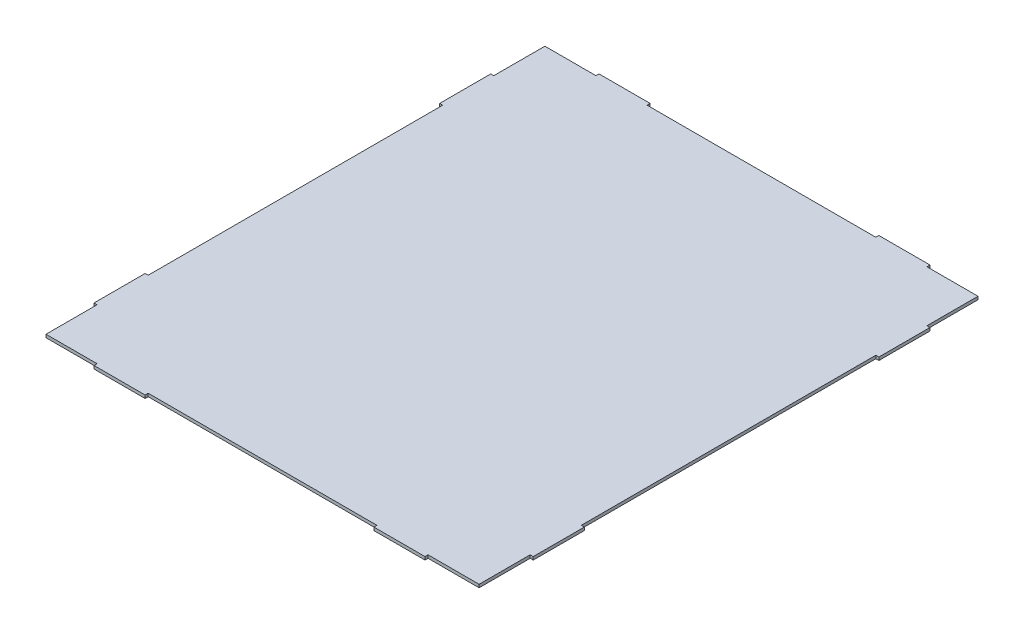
ISO-10303-21;
HEADER;
FILE_DESCRIPTION(('STEP AP214'),'2;1');
FILE_NAME('part.step','',(''),(''),'','','');
FILE_SCHEMA(('AUTOMOTIVE_DESIGN { 1 0 10303 214 1 1 1 1 }'));
ENDSEC;
DATA;
#1=APPLICATION_CONTEXT('core data for automotive mechanical design processes');
#2=APPLICATION_PROTOCOL_DEFINITION('international standard','automotive_design',2000,#1);
#3=PRODUCT_CONTEXT('',#1,'mechanical');
#4=PRODUCT('Part','Part','',(#3));
#5=PRODUCT_RELATED_PRODUCT_CATEGORY('part','',(#4));
#6=PRODUCT_DEFINITION_FORMATION('','',#4);
#7=PRODUCT_DEFINITION_CONTEXT('part definition',#1,'design');
#8=PRODUCT_DEFINITION('design','',#6,#7);
#9=PRODUCT_DEFINITION_SHAPE('','',#8);
#10=(LENGTH_UNIT() NAMED_UNIT(*) SI_UNIT(.MILLI.,.METRE.));
#11=(NAMED_UNIT(*) PLANE_ANGLE_UNIT() SI_UNIT($,.RADIAN.));
#12=(NAMED_UNIT(*) SI_UNIT($,.STERADIAN.) SOLID_ANGLE_UNIT());
#13=UNCERTAINTY_MEASURE_WITH_UNIT(LENGTH_MEASURE(1.E-05),#10,'distance_accuracy_value','');
#14=(GEOMETRIC_REPRESENTATION_CONTEXT(3) GLOBAL_UNCERTAINTY_ASSIGNED_CONTEXT((#13)) GLOBAL_UNIT_ASSIGNED_CONTEXT((#10,
#11,#12)) REPRESENTATION_CONTEXT('',''));
#15=CARTESIAN_POINT('',(0.,0.,0.));
#16=DIRECTION('',(0.,0.,1.));
#17=DIRECTION('',(1.,0.,0.));
#18=AXIS2_PLACEMENT_3D('',#15,#16,#17);
#19=CARTESIAN_POINT('',(0.,3.,0.));
#20=DIRECTION('',(1.,0.,0.));
#21=DIRECTION('',(0.,0.,-1.));
#22=AXIS2_PLACEMENT_3D('',#19,#20,#21);
#23=PLANE('',#22);
#24=DIRECTION('',(0.,0.,1.));
#25=VECTOR('',#24,1.);
#26=CARTESIAN_POINT('',(0.,0.,0.));
#27=LINE('',#26,#25);
#28=CARTESIAN_POINT('',(0.,0.,-50.));
#29=VERTEX_POINT('',#28);
#30=CARTESIAN_POINT('',(0.,0.,0.));
#31=VERTEX_POINT('',#30);
#32=EDGE_CURVE('E300',#29,#31,#27,.T.);
#33=ORIENTED_EDGE('',*,*,#32,.T.);
#34=DIRECTION('',(0.,-1.,0.));
#35=VECTOR('',#34,1.);
#36=CARTESIAN_POINT('',(0.,3.,0.));
#37=LINE('',#36,#35);
#38=CARTESIAN_POINT('',(0.,3.,0.));
#39=VERTEX_POINT('',#38);
#40=EDGE_CURVE('E11',#39,#31,#37,.T.);
#41=ORIENTED_EDGE('',*,*,#40,.F.);
#42=DIRECTION('',(0.,0.,1.));
#43=VECTOR('',#42,1.);
#44=CARTESIAN_POINT('',(0.,3.,0.));
#45=LINE('',#44,#43);
#46=CARTESIAN_POINT('',(0.,3.,-50.));
#47=VERTEX_POINT('',#46);
#48=EDGE_CURVE('E370',#47,#39,#45,.T.);
#49=ORIENTED_EDGE('',*,*,#48,.F.);
#50=DIRECTION('',(0.,-1.,0.));
#51=VECTOR('',#50,1.);
#52=CARTESIAN_POINT('',(0.,3.,-50.));
#53=LINE('',#52,#51);
#54=EDGE_CURVE('E296',#47,#29,#53,.T.);
#55=ORIENTED_EDGE('',*,*,#54,.T.);
#56=EDGE_LOOP('',(#33,#41,#49,#55));
#57=FACE_BOUND('',#56,.T.);
#58=ADVANCED_FACE('F36',(#57),#23,.F.);
#59=CARTESIAN_POINT('',(0.,3.,0.));
#60=DIRECTION('',(0.,0.,-1.));
#61=DIRECTION('',(-1.,0.,0.));
#62=AXIS2_PLACEMENT_3D('',#59,#60,#61);
#63=PLANE('',#62);
#64=DIRECTION('',(1.,0.,0.));
#65=VECTOR('',#64,1.);
#66=CARTESIAN_POINT('',(0.,0.,0.));
#67=LINE('',#66,#65);
#68=CARTESIAN_POINT('',(50.,0.,0.));
#69=VERTEX_POINT('',#68);
#70=EDGE_CURVE('E303',#31,#69,#67,.T.);
#71=ORIENTED_EDGE('',*,*,#70,.T.);
#72=DIRECTION('',(0.,-1.,0.));
#73=VECTOR('',#72,1.);
#74=CARTESIAN_POINT('',(50.,3.,0.));
#75=LINE('',#74,#73);
#76=CARTESIAN_POINT('',(50.,3.,0.));
#77=VERTEX_POINT('',#76);
#78=EDGE_CURVE('E44',#77,#69,#75,.T.);
#79=ORIENTED_EDGE('',*,*,#78,.F.);
#80=DIRECTION('',(1.,0.,0.));
#81=VECTOR('',#80,1.);
#82=CARTESIAN_POINT('',(0.,3.,0.));
#83=LINE('',#82,#81);
#84=EDGE_CURVE('E179',#39,#77,#83,.T.);
#85=ORIENTED_EDGE('',*,*,#84,.F.);
#86=ORIENTED_EDGE('',*,*,#40,.T.);
#87=EDGE_LOOP('',(#71,#79,#85,#86));
#88=FACE_BOUND('',#87,.T.);
#89=ADVANCED_FACE('F568',(#88),#63,.F.);
#90=CARTESIAN_POINT('',(50.,3.,0.));
#91=DIRECTION('',(1.,0.,0.));
#92=DIRECTION('',(0.,0.,-1.));
#93=AXIS2_PLACEMENT_3D('',#90,#91,#92);
#94=PLANE('',#93);
#95=DIRECTION('',(0.,0.,1.));
#96=VECTOR('',#95,1.);
#97=CARTESIAN_POINT('',(50.,0.,0.));
#98=LINE('',#97,#96);
#99=CARTESIAN_POINT('',(50.,0.,3.));
#100=VERTEX_POINT('',#99);
#101=EDGE_CURVE('E305',#69,#100,#98,.T.);
#102=ORIENTED_EDGE('',*,*,#101,.T.);
#103=DIRECTION('',(0.,-1.,0.));
#104=VECTOR('',#103,1.);
#105=CARTESIAN_POINT('',(50.,3.,3.));
#106=LINE('',#105,#104);
#107=CARTESIAN_POINT('',(50.,3.,3.));
#108=VERTEX_POINT('',#107);
#109=EDGE_CURVE('E461',#108,#100,#106,.T.);
#110=ORIENTED_EDGE('',*,*,#109,.F.);
#111=DIRECTION('',(0.,0.,1.));
#112=VECTOR('',#111,1.);
#113=CARTESIAN_POINT('',(50.,3.,0.));
#114=LINE('',#113,#112);
#115=EDGE_CURVE('E469',#77,#108,#114,.T.);
#116=ORIENTED_EDGE('',*,*,#115,.F.);
#117=ORIENTED_EDGE('',*,*,#78,.T.);
#118=EDGE_LOOP('',(#102,#110,#116,#117));
#119=FACE_BOUND('',#118,.T.);
#120=ADVANCED_FACE('F467',(#119),#94,.F.);
#121=CARTESIAN_POINT('',(50.,3.,3.));
#122=DIRECTION('',(0.,0.,-1.));
#123=DIRECTION('',(-1.,0.,0.));
#124=AXIS2_PLACEMENT_3D('',#121,#122,#123);
#125=PLANE('',#124);
#126=DIRECTION('',(1.,0.,0.));
#127=VECTOR('',#126,1.);
#128=CARTESIAN_POINT('',(50.,0.,3.));
#129=LINE('',#128,#127);
#130=CARTESIAN_POINT('',(100.,0.,3.));
#131=VERTEX_POINT('',#130);
#132=EDGE_CURVE('E307',#100,#131,#129,.T.);
#133=ORIENTED_EDGE('',*,*,#132,.T.);
#134=DIRECTION('',(0.,-1.,0.));
#135=VECTOR('',#134,1.);
#136=CARTESIAN_POINT('',(100.,3.,3.));
#137=LINE('',#136,#135);
#138=CARTESIAN_POINT('',(100.,3.,3.));
#139=VERTEX_POINT('',#138);
#140=EDGE_CURVE('E458',#139,#131,#137,.T.);
#141=ORIENTED_EDGE('',*,*,#140,.F.);
#142=DIRECTION('',(1.,0.,0.));
#143=VECTOR('',#142,1.);
#144=CARTESIAN_POINT('',(50.,3.,3.));
#145=LINE('',#144,#143);
#146=EDGE_CURVE('E487',#108,#139,#145,.T.);
#147=ORIENTED_EDGE('',*,*,#146,.F.);
#148=ORIENTED_EDGE('',*,*,#109,.T.);
#149=EDGE_LOOP('',(#133,#141,#147,#148));
#150=FACE_BOUND('',#149,.T.);
#151=ADVANCED_FACE('F478',(#150),#125,.F.);
#152=CARTESIAN_POINT('',(100.,3.,0.));
#153=DIRECTION('',(-1.,0.,0.));
#154=DIRECTION('',(0.,0.,1.));
#155=AXIS2_PLACEMENT_3D('',#152,#153,#154);
#156=PLANE('',#155);
#157=DIRECTION('',(0.,0.,-1.));
#158=VECTOR('',#157,1.);
#159=CARTESIAN_POINT('',(100.,0.,0.));
#160=LINE('',#159,#158);
#161=CARTESIAN_POINT('',(100.,0.,0.));
#162=VERTEX_POINT('',#161);
#163=EDGE_CURVE('E309',#131,#162,#160,.T.);
#164=ORIENTED_EDGE('',*,*,#163,.T.);
#165=DIRECTION('',(0.,-1.,0.));
#166=VECTOR('',#165,1.);
#167=CARTESIAN_POINT('',(100.,3.,0.));
#168=LINE('',#167,#166);
#169=CARTESIAN_POINT('',(100.,3.,0.));
#170=VERTEX_POINT('',#169);
#171=EDGE_CURVE('E455',#170,#162,#168,.T.);
#172=ORIENTED_EDGE('',*,*,#171,.F.);
#173=DIRECTION('',(0.,0.,-1.));
#174=VECTOR('',#173,1.);
#175=CARTESIAN_POINT('',(100.,3.,0.));
#176=LINE('',#175,#174);
#177=EDGE_CURVE('E484',#139,#170,#176,.T.);
#178=ORIENTED_EDGE('',*,*,#177,.F.);
#179=ORIENTED_EDGE('',*,*,#140,.T.);
#180=EDGE_LOOP('',(#164,#172,#178,#179));
#181=FACE_BOUND('',#180,.T.);
#182=ADVANCED_FACE('F482',(#181),#156,.F.);
#183=CARTESIAN_POINT('',(100.,3.,0.));
#184=DIRECTION('',(0.,0.,-1.));
#185=DIRECTION('',(-1.,0.,0.));
#186=AXIS2_PLACEMENT_3D('',#183,#184,#185);
#187=PLANE('',#186);
#188=DIRECTION('',(1.,0.,0.));
#189=VECTOR('',#188,1.);
#190=CARTESIAN_POINT('',(100.,0.,0.));
#191=LINE('',#190,#189);
#192=CARTESIAN_POINT('',(324.,0.,0.));
#193=VERTEX_POINT('',#192);
#194=EDGE_CURVE('E311',#162,#193,#191,.T.);
#195=ORIENTED_EDGE('',*,*,#194,.T.);
#196=DIRECTION('',(0.,-1.,0.));
#197=VECTOR('',#196,1.);
#198=CARTESIAN_POINT('',(324.,3.,0.));
#199=LINE('',#198,#197);
#200=CARTESIAN_POINT('',(324.,3.,0.));
#201=VERTEX_POINT('',#200);
#202=EDGE_CURVE('E452',#201,#193,#199,.T.);
#203=ORIENTED_EDGE('',*,*,#202,.F.);
#204=DIRECTION('',(1.,0.,0.));
#205=VECTOR('',#204,1.);
#206=CARTESIAN_POINT('',(100.,3.,0.));
#207=LINE('',#206,#205);
#208=EDGE_CURVE('E486',#170,#201,#207,.T.);
#209=ORIENTED_EDGE('',*,*,#208,.F.);
#210=ORIENTED_EDGE('',*,*,#171,.T.);
#211=EDGE_LOOP('',(#195,#203,#209,#210));
#212=FACE_BOUND('',#211,.T.);
#213=ADVANCED_FACE('F581',(#212),#187,.F.);
#214=CARTESIAN_POINT('',(324.,3.,0.));
#215=DIRECTION('',(1.,0.,0.));
#216=DIRECTION('',(0.,0.,-1.));
#217=AXIS2_PLACEMENT_3D('',#214,#215,#216);
#218=PLANE('',#217);
#219=DIRECTION('',(0.,0.,1.));
#220=VECTOR('',#219,1.);
#221=CARTESIAN_POINT('',(324.,0.,0.));
#222=LINE('',#221,#220);
#223=CARTESIAN_POINT('',(324.,0.,3.));
#224=VERTEX_POINT('',#223);
#225=EDGE_CURVE('E313',#193,#224,#222,.T.);
#226=ORIENTED_EDGE('',*,*,#225,.T.);
#227=DIRECTION('',(0.,-1.,0.));
#228=VECTOR('',#227,1.);
#229=CARTESIAN_POINT('',(324.,3.,3.));
#230=LINE('',#229,#228);
#231=CARTESIAN_POINT('',(324.,3.,3.));
#232=VERTEX_POINT('',#231);
#233=EDGE_CURVE('E449',#232,#224,#230,.T.);
#234=ORIENTED_EDGE('',*,*,#233,.F.);
#235=DIRECTION('',(0.,0.,1.));
#236=VECTOR('',#235,1.);
#237=CARTESIAN_POINT('',(324.,3.,0.));
#238=LINE('',#237,#236);
#239=EDGE_CURVE('E489',#201,#232,#238,.T.);
#240=ORIENTED_EDGE('',*,*,#239,.F.);
#241=ORIENTED_EDGE('',*,*,#202,.T.);
#242=EDGE_LOOP('',(#226,#234,#240,#241));
#243=FACE_BOUND('',#242,.T.);
#244=ADVANCED_FACE('F584',(#243),#218,.F.);
#245=CARTESIAN_POINT('',(324.,3.,3.));
#246=DIRECTION('',(0.,0.,-1.));
#247=DIRECTION('',(-1.,0.,0.));
#248=AXIS2_PLACEMENT_3D('',#245,#246,#247);
#249=PLANE('',#248);
#250=DIRECTION('',(1.,0.,0.));
#251=VECTOR('',#250,1.);
#252=CARTESIAN_POINT('',(324.,0.,3.));
#253=LINE('',#252,#251);
#254=CARTESIAN_POINT('',(374.,0.,3.));
#255=VERTEX_POINT('',#254);
#256=EDGE_CURVE('E315',#224,#255,#253,.T.);
#257=ORIENTED_EDGE('',*,*,#256,.T.);
#258=DIRECTION('',(0.,-1.,0.));
#259=VECTOR('',#258,1.);
#260=CARTESIAN_POINT('',(374.,3.,3.));
#261=LINE('',#260,#259);
#262=CARTESIAN_POINT('',(374.,3.,3.));
#263=VERTEX_POINT('',#262);
#264=EDGE_CURVE('E446',#263,#255,#261,.T.);
#265=ORIENTED_EDGE('',*,*,#264,.F.);
#266=DIRECTION('',(1.,0.,0.));
#267=VECTOR('',#266,1.);
#268=CARTESIAN_POINT('',(324.,3.,3.));
#269=LINE('',#268,#267);
#270=EDGE_CURVE('E495',#232,#263,#269,.T.);
#271=ORIENTED_EDGE('',*,*,#270,.F.);
#272=ORIENTED_EDGE('',*,*,#233,.T.);
#273=EDGE_LOOP('',(#257,#265,#271,#272));
#274=FACE_BOUND('',#273,.T.);
#275=ADVANCED_FACE('F588',(#274),#249,.F.);
#276=CARTESIAN_POINT('',(374.,3.,0.));
#277=DIRECTION('',(-1.,0.,0.));
#278=DIRECTION('',(0.,0.,1.));
#279=AXIS2_PLACEMENT_3D('',#276,#277,#278);
#280=PLANE('',#279);
#281=DIRECTION('',(0.,0.,-1.));
#282=VECTOR('',#281,1.);
#283=CARTESIAN_POINT('',(374.,0.,0.));
#284=LINE('',#283,#282);
#285=CARTESIAN_POINT('',(374.,0.,0.));
#286=VERTEX_POINT('',#285);
#287=EDGE_CURVE('E317',#255,#286,#284,.T.);
#288=ORIENTED_EDGE('',*,*,#287,.T.);
#289=DIRECTION('',(0.,-1.,0.));
#290=VECTOR('',#289,1.);
#291=CARTESIAN_POINT('',(374.,3.,0.));
#292=LINE('',#291,#290);
#293=CARTESIAN_POINT('',(374.,3.,0.));
#294=VERTEX_POINT('',#293);
#295=EDGE_CURVE('E443',#294,#286,#292,.T.);
#296=ORIENTED_EDGE('',*,*,#295,.F.);
#297=DIRECTION('',(0.,0.,-1.));
#298=VECTOR('',#297,1.);
#299=CARTESIAN_POINT('',(374.,3.,0.));
#300=LINE('',#299,#298);
#301=EDGE_CURVE('E497',#263,#294,#300,.T.);
#302=ORIENTED_EDGE('',*,*,#301,.F.);
#303=ORIENTED_EDGE('',*,*,#264,.T.);
#304=EDGE_LOOP('',(#288,#296,#302,#303));
#305=FACE_BOUND('',#304,.T.);
#306=ADVANCED_FACE('F592',(#305),#280,.F.);
#307=CARTESIAN_POINT('',(374.,3.,0.));
#308=DIRECTION('',(0.,0.,-1.));
#309=DIRECTION('',(-1.,0.,0.));
#310=AXIS2_PLACEMENT_3D('',#307,#308,#309);
#311=PLANE('',#310);
#312=DIRECTION('',(1.,0.,0.));
#313=VECTOR('',#312,1.);
#314=CARTESIAN_POINT('',(374.,0.,0.));
#315=LINE('',#314,#313);
#316=CARTESIAN_POINT('',(424.,0.,0.));
#317=VERTEX_POINT('',#316);
#318=EDGE_CURVE('E319',#286,#317,#315,.T.);
#319=ORIENTED_EDGE('',*,*,#318,.T.);
#320=DIRECTION('',(0.,-1.,0.));
#321=VECTOR('',#320,1.);
#322=CARTESIAN_POINT('',(424.,3.,0.));
#323=LINE('',#322,#321);
#324=CARTESIAN_POINT('',(424.,3.,0.));
#325=VERTEX_POINT('',#324);
#326=EDGE_CURVE('E440',#325,#317,#323,.T.);
#327=ORIENTED_EDGE('',*,*,#326,.F.);
#328=DIRECTION('',(1.,0.,0.));
#329=VECTOR('',#328,1.);
#330=CARTESIAN_POINT('',(374.,3.,0.));
#331=LINE('',#330,#329);
#332=EDGE_CURVE('E499',#294,#325,#331,.T.);
#333=ORIENTED_EDGE('',*,*,#332,.F.);
#334=ORIENTED_EDGE('',*,*,#295,.T.);
#335=EDGE_LOOP('',(#319,#327,#333,#334));
#336=FACE_BOUND('',#335,.T.);
#337=ADVANCED_FACE('F596',(#336),#311,.F.);
#338=CARTESIAN_POINT('',(424.,3.,0.));
#339=DIRECTION('',(-1.,0.,0.));
#340=DIRECTION('',(0.,0.,1.));
#341=AXIS2_PLACEMENT_3D('',#338,#339,#340);
#342=PLANE('',#341);
#343=DIRECTION('',(0.,0.,-1.));
#344=VECTOR('',#343,1.);
#345=CARTESIAN_POINT('',(424.,0.,0.));
#346=LINE('',#345,#344);
#347=CARTESIAN_POINT('',(424.,0.,-50.));
#348=VERTEX_POINT('',#347);
#349=EDGE_CURVE('E321',#317,#348,#346,.T.);
#350=ORIENTED_EDGE('',*,*,#349,.T.);
#351=DIRECTION('',(0.,-1.,0.));
#352=VECTOR('',#351,1.);
#353=CARTESIAN_POINT('',(424.,3.,-50.));
#354=LINE('',#353,#352);
#355=CARTESIAN_POINT('',(424.,3.,-50.));
#356=VERTEX_POINT('',#355);
#357=EDGE_CURVE('E437',#356,#348,#354,.T.);
#358=ORIENTED_EDGE('',*,*,#357,.F.);
#359=DIRECTION('',(0.,0.,-1.));
#360=VECTOR('',#359,1.);
#361=CARTESIAN_POINT('',(424.,3.,0.));
#362=LINE('',#361,#360);
#363=EDGE_CURVE('E501',#325,#356,#362,.T.);
#364=ORIENTED_EDGE('',*,*,#363,.F.);
#365=ORIENTED_EDGE('',*,*,#326,.T.);
#366=EDGE_LOOP('',(#350,#358,#364,#365));
#367=FACE_BOUND('',#366,.T.);
#368=ADVANCED_FACE('F600',(#367),#342,.F.);
#369=CARTESIAN_POINT('',(424.,3.,-50.));
#370=DIRECTION('',(0.,0.,-1.));
#371=DIRECTION('',(-1.,0.,0.));
#372=AXIS2_PLACEMENT_3D('',#369,#370,#371);
#373=PLANE('',#372);
#374=DIRECTION('',(1.,0.,0.));
#375=VECTOR('',#374,1.);
#376=CARTESIAN_POINT('',(424.,0.,-50.));
#377=LINE('',#376,#375);
#378=CARTESIAN_POINT('',(427.,0.,-50.0000000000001));
#379=VERTEX_POINT('',#378);
#380=EDGE_CURVE('E323',#348,#379,#377,.T.);
#381=ORIENTED_EDGE('',*,*,#380,.T.);
#382=DIRECTION('',(0.,-1.,0.));
#383=VECTOR('',#382,1.);
#384=CARTESIAN_POINT('',(427.,3.,-50.0000000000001));
#385=LINE('',#384,#383);
#386=CARTESIAN_POINT('',(427.,3.,-50.0000000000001));
#387=VERTEX_POINT('',#386);
#388=EDGE_CURVE('E434',#387,#379,#385,.T.);
#389=ORIENTED_EDGE('',*,*,#388,.F.);
#390=DIRECTION('',(1.,0.,0.));
#391=VECTOR('',#390,1.);
#392=CARTESIAN_POINT('',(424.,3.,-50.));
#393=LINE('',#392,#391);
#394=EDGE_CURVE('E503',#356,#387,#393,.T.);
#395=ORIENTED_EDGE('',*,*,#394,.F.);
#396=ORIENTED_EDGE('',*,*,#357,.T.);
#397=EDGE_LOOP('',(#381,#389,#395,#396));
#398=FACE_BOUND('',#397,.T.);
#399=ADVANCED_FACE('F604',(#398),#373,.F.);
#400=CARTESIAN_POINT('',(427.,3.,-100.));
#401=DIRECTION('',(-1.,0.,0.));
#402=DIRECTION('',(0.,0.,1.));
#403=AXIS2_PLACEMENT_3D('',#400,#401,#402);
#404=PLANE('',#403);
#405=DIRECTION('',(0.,0.,-1.));
#406=VECTOR('',#405,1.);
#407=CARTESIAN_POINT('',(427.,0.,-100.));
#408=LINE('',#407,#406);
#409=CARTESIAN_POINT('',(427.,0.,-100.));
#410=VERTEX_POINT('',#409);
#411=EDGE_CURVE('E325',#379,#410,#408,.T.);
#412=ORIENTED_EDGE('',*,*,#411,.T.);
#413=DIRECTION('',(0.,-1.,0.));
#414=VECTOR('',#413,1.);
#415=CARTESIAN_POINT('',(427.,3.,-100.));
#416=LINE('',#415,#414);
#417=CARTESIAN_POINT('',(427.,3.,-100.));
#418=VERTEX_POINT('',#417);
#419=EDGE_CURVE('E431',#418,#410,#416,.T.);
#420=ORIENTED_EDGE('',*,*,#419,.F.);
#421=DIRECTION('',(0.,0.,-1.));
#422=VECTOR('',#421,1.);
#423=CARTESIAN_POINT('',(427.,3.,-100.));
#424=LINE('',#423,#422);
#425=EDGE_CURVE('E505',#387,#418,#424,.T.);
#426=ORIENTED_EDGE('',*,*,#425,.F.);
#427=ORIENTED_EDGE('',*,*,#388,.T.);
#428=EDGE_LOOP('',(#412,#420,#426,#427));
#429=FACE_BOUND('',#428,.T.);
#430=ADVANCED_FACE('F608',(#429),#404,.F.);
#431=CARTESIAN_POINT('',(427.,3.,-100.));
#432=DIRECTION('',(0.,0.,1.));
#433=DIRECTION('',(1.,0.,0.));
#434=AXIS2_PLACEMENT_3D('',#431,#432,#433);
#435=PLANE('',#434);
#436=DIRECTION('',(-1.,0.,0.));
#437=VECTOR('',#436,1.);
#438=CARTESIAN_POINT('',(427.,0.,-100.));
#439=LINE('',#438,#437);
#440=CARTESIAN_POINT('',(424.,0.,-100.));
#441=VERTEX_POINT('',#440);
#442=EDGE_CURVE('E327',#410,#441,#439,.T.);
#443=ORIENTED_EDGE('',*,*,#442,.T.);
#444=DIRECTION('',(0.,-1.,0.));
#445=VECTOR('',#444,1.);
#446=CARTESIAN_POINT('',(424.,3.,-100.));
#447=LINE('',#446,#445);
#448=CARTESIAN_POINT('',(424.,3.,-100.));
#449=VERTEX_POINT('',#448);
#450=EDGE_CURVE('E428',#449,#441,#447,.T.);
#451=ORIENTED_EDGE('',*,*,#450,.F.);
#452=DIRECTION('',(-1.,0.,0.));
#453=VECTOR('',#452,1.);
#454=CARTESIAN_POINT('',(427.,3.,-100.));
#455=LINE('',#454,#453);
#456=EDGE_CURVE('E507',#418,#449,#455,.T.);
#457=ORIENTED_EDGE('',*,*,#456,.F.);
#458=ORIENTED_EDGE('',*,*,#419,.T.);
#459=EDGE_LOOP('',(#443,#451,#457,#458));
#460=FACE_BOUND('',#459,.T.);
#461=ADVANCED_FACE('F612',(#460),#435,.F.);
#462=CARTESIAN_POINT('',(424.,3.,-100.));
#463=DIRECTION('',(-1.,0.,0.));
#464=DIRECTION('',(0.,0.,1.));
#465=AXIS2_PLACEMENT_3D('',#462,#463,#464);
#466=PLANE('',#465);
#467=DIRECTION('',(0.,0.,-1.));
#468=VECTOR('',#467,1.);
#469=CARTESIAN_POINT('',(424.,0.,-100.));
#470=LINE('',#469,#468);
#471=CARTESIAN_POINT('',(424.,0.,-388.4));
#472=VERTEX_POINT('',#471);
#473=EDGE_CURVE('E329',#441,#472,#470,.T.);
#474=ORIENTED_EDGE('',*,*,#473,.T.);
#475=DIRECTION('',(0.,-1.,0.));
#476=VECTOR('',#475,1.);
#477=CARTESIAN_POINT('',(424.,3.,-388.4));
#478=LINE('',#477,#476);
#479=CARTESIAN_POINT('',(424.,3.,-388.4));
#480=VERTEX_POINT('',#479);
#481=EDGE_CURVE('E425',#480,#472,#478,.T.);
#482=ORIENTED_EDGE('',*,*,#481,.F.);
#483=DIRECTION('',(0.,0.,-1.));
#484=VECTOR('',#483,1.);
#485=CARTESIAN_POINT('',(424.,3.,-100.));
#486=LINE('',#485,#484);
#487=EDGE_CURVE('E509',#449,#480,#486,.T.);
#488=ORIENTED_EDGE('',*,*,#487,.F.);
#489=ORIENTED_EDGE('',*,*,#450,.T.);
#490=EDGE_LOOP('',(#474,#482,#488,#489));
#491=FACE_BOUND('',#490,.T.);
#492=ADVANCED_FACE('F616',(#491),#466,.F.);
#493=CARTESIAN_POINT('',(427.,3.,-388.4));
#494=DIRECTION('',(0.,0.,-1.));
#495=DIRECTION('',(-1.,0.,0.));
#496=AXIS2_PLACEMENT_3D('',#493,#494,#495);
#497=PLANE('',#496);
#498=DIRECTION('',(1.,0.,0.));
#499=VECTOR('',#498,1.);
#500=CARTESIAN_POINT('',(427.,0.,-388.4));
#501=LINE('',#500,#499);
#502=CARTESIAN_POINT('',(427.,0.,-388.4));
#503=VERTEX_POINT('',#502);
#504=EDGE_CURVE('E331',#472,#503,#501,.T.);
#505=ORIENTED_EDGE('',*,*,#504,.T.);
#506=DIRECTION('',(0.,-1.,0.));
#507=VECTOR('',#506,1.);
#508=CARTESIAN_POINT('',(427.,3.,-388.4));
#509=LINE('',#508,#507);
#510=CARTESIAN_POINT('',(427.,3.,-388.4));
#511=VERTEX_POINT('',#510);
#512=EDGE_CURVE('E422',#511,#503,#509,.T.);
#513=ORIENTED_EDGE('',*,*,#512,.F.);
#514=DIRECTION('',(1.,0.,0.));
#515=VECTOR('',#514,1.);
#516=CARTESIAN_POINT('',(427.,3.,-388.4));
#517=LINE('',#516,#515);
#518=EDGE_CURVE('E511',#480,#511,#517,.T.);
#519=ORIENTED_EDGE('',*,*,#518,.F.);
#520=ORIENTED_EDGE('',*,*,#481,.T.);
#521=EDGE_LOOP('',(#505,#513,#519,#520));
#522=FACE_BOUND('',#521,.T.);
#523=ADVANCED_FACE('F620',(#522),#497,.F.);
#524=CARTESIAN_POINT('',(427.,3.,-438.4));
#525=DIRECTION('',(-1.,0.,0.));
#526=DIRECTION('',(0.,0.,1.));
#527=AXIS2_PLACEMENT_3D('',#524,#525,#526);
#528=PLANE('',#527);
#529=DIRECTION('',(0.,0.,-1.));
#530=VECTOR('',#529,1.);
#531=CARTESIAN_POINT('',(427.,0.,-438.4));
#532=LINE('',#531,#530);
#533=CARTESIAN_POINT('',(427.,0.,-438.4));
#534=VERTEX_POINT('',#533);
#535=EDGE_CURVE('E333',#503,#534,#532,.T.);
#536=ORIENTED_EDGE('',*,*,#535,.T.);
#537=DIRECTION('',(0.,-1.,0.));
#538=VECTOR('',#537,1.);
#539=CARTESIAN_POINT('',(427.,3.,-438.4));
#540=LINE('',#539,#538);
#541=CARTESIAN_POINT('',(427.,3.,-438.4));
#542=VERTEX_POINT('',#541);
#543=EDGE_CURVE('E419',#542,#534,#540,.T.);
#544=ORIENTED_EDGE('',*,*,#543,.F.);
#545=DIRECTION('',(0.,0.,-1.));
#546=VECTOR('',#545,1.);
#547=CARTESIAN_POINT('',(427.,3.,-438.4));
#548=LINE('',#547,#546);
#549=EDGE_CURVE('E513',#511,#542,#548,.T.);
#550=ORIENTED_EDGE('',*,*,#549,.F.);
#551=ORIENTED_EDGE('',*,*,#512,.T.);
#552=EDGE_LOOP('',(#536,#544,#550,#551));
#553=FACE_BOUND('',#552,.T.);
#554=ADVANCED_FACE('F624',(#553),#528,.F.);
#555=CARTESIAN_POINT('',(427.,3.,-438.4));
#556=DIRECTION('',(0.,0.,1.));
#557=DIRECTION('',(1.,0.,0.));
#558=AXIS2_PLACEMENT_3D('',#555,#556,#557);
#559=PLANE('',#558);
#560=DIRECTION('',(-1.,0.,0.));
#561=VECTOR('',#560,1.);
#562=CARTESIAN_POINT('',(427.,0.,-438.4));
#563=LINE('',#562,#561);
#564=CARTESIAN_POINT('',(424.,0.,-438.4));
#565=VERTEX_POINT('',#564);
#566=EDGE_CURVE('E335',#534,#565,#563,.T.);
#567=ORIENTED_EDGE('',*,*,#566,.T.);
#568=DIRECTION('',(0.,-1.,0.));
#569=VECTOR('',#568,1.);
#570=CARTESIAN_POINT('',(424.,3.,-438.4));
#571=LINE('',#570,#569);
#572=CARTESIAN_POINT('',(424.,3.,-438.4));
#573=VERTEX_POINT('',#572);
#574=EDGE_CURVE('E416',#573,#565,#571,.T.);
#575=ORIENTED_EDGE('',*,*,#574,.F.);
#576=DIRECTION('',(-1.,0.,0.));
#577=VECTOR('',#576,1.);
#578=CARTESIAN_POINT('',(427.,3.,-438.4));
#579=LINE('',#578,#577);
#580=EDGE_CURVE('E515',#542,#573,#579,.T.);
#581=ORIENTED_EDGE('',*,*,#580,.F.);
#582=ORIENTED_EDGE('',*,*,#543,.T.);
#583=EDGE_LOOP('',(#567,#575,#581,#582));
#584=FACE_BOUND('',#583,.T.);
#585=ADVANCED_FACE('F628',(#584),#559,.F.);
#586=CARTESIAN_POINT('',(424.,3.,-438.4));
#587=DIRECTION('',(-1.,0.,0.));
#588=DIRECTION('',(0.,0.,1.));
#589=AXIS2_PLACEMENT_3D('',#586,#587,#588);
#590=PLANE('',#589);
#591=DIRECTION('',(0.,0.,-1.));
#592=VECTOR('',#591,1.);
#593=CARTESIAN_POINT('',(424.,0.,-438.4));
#594=LINE('',#593,#592);
#595=CARTESIAN_POINT('',(424.,0.,-488.4));
#596=VERTEX_POINT('',#595);
#597=EDGE_CURVE('E337',#565,#596,#594,.T.);
#598=ORIENTED_EDGE('',*,*,#597,.T.);
#599=DIRECTION('',(0.,-1.,0.));
#600=VECTOR('',#599,1.);
#601=CARTESIAN_POINT('',(424.,3.,-488.4));
#602=LINE('',#601,#600);
#603=CARTESIAN_POINT('',(424.,3.,-488.4));
#604=VERTEX_POINT('',#603);
#605=EDGE_CURVE('E413',#604,#596,#602,.T.);
#606=ORIENTED_EDGE('',*,*,#605,.F.);
#607=DIRECTION('',(0.,0.,-1.));
#608=VECTOR('',#607,1.);
#609=CARTESIAN_POINT('',(424.,3.,-438.4));
#610=LINE('',#609,#608);
#611=EDGE_CURVE('E517',#573,#604,#610,.T.);
#612=ORIENTED_EDGE('',*,*,#611,.F.);
#613=ORIENTED_EDGE('',*,*,#574,.T.);
#614=EDGE_LOOP('',(#598,#606,#612,#613));
#615=FACE_BOUND('',#614,.T.);
#616=ADVANCED_FACE('F632',(#615),#590,.F.);
#617=CARTESIAN_POINT('',(374.,3.,-488.4));
#618=DIRECTION('',(0.,0.,1.));
#619=DIRECTION('',(1.,0.,0.));
#620=AXIS2_PLACEMENT_3D('',#617,#618,#619);
#621=PLANE('',#620);
#622=DIRECTION('',(-1.,0.,0.));
#623=VECTOR('',#622,1.);
#624=CARTESIAN_POINT('',(374.,0.,-488.4));
#625=LINE('',#624,#623);
#626=CARTESIAN_POINT('',(374.,0.,-488.4));
#627=VERTEX_POINT('',#626);
#628=EDGE_CURVE('E339',#596,#627,#625,.T.);
#629=ORIENTED_EDGE('',*,*,#628,.T.);
#630=DIRECTION('',(0.,-1.,0.));
#631=VECTOR('',#630,1.);
#632=CARTESIAN_POINT('',(374.,3.,-488.4));
#633=LINE('',#632,#631);
#634=CARTESIAN_POINT('',(374.,3.,-488.4));
#635=VERTEX_POINT('',#634);
#636=EDGE_CURVE('E410',#635,#627,#633,.T.);
#637=ORIENTED_EDGE('',*,*,#636,.F.);
#638=DIRECTION('',(-1.,0.,0.));
#639=VECTOR('',#638,1.);
#640=CARTESIAN_POINT('',(374.,3.,-488.4));
#641=LINE('',#640,#639);
#642=EDGE_CURVE('E519',#604,#635,#641,.T.);
#643=ORIENTED_EDGE('',*,*,#642,.F.);
#644=ORIENTED_EDGE('',*,*,#605,.T.);
#645=EDGE_LOOP('',(#629,#637,#643,#644));
#646=FACE_BOUND('',#645,.T.);
#647=ADVANCED_FACE('F636',(#646),#621,.F.);
#648=CARTESIAN_POINT('',(374.,3.,-488.4));
#649=DIRECTION('',(-1.,0.,0.));
#650=DIRECTION('',(0.,0.,1.));
#651=AXIS2_PLACEMENT_3D('',#648,#649,#650);
#652=PLANE('',#651);
#653=DIRECTION('',(0.,0.,-1.));
#654=VECTOR('',#653,1.);
#655=CARTESIAN_POINT('',(374.,0.,-488.4));
#656=LINE('',#655,#654);
#657=CARTESIAN_POINT('',(374.,0.,-491.4));
#658=VERTEX_POINT('',#657);
#659=EDGE_CURVE('E341',#627,#658,#656,.T.);
#660=ORIENTED_EDGE('',*,*,#659,.T.);
#661=DIRECTION('',(0.,-1.,0.));
#662=VECTOR('',#661,1.);
#663=CARTESIAN_POINT('',(374.,3.,-491.4));
#664=LINE('',#663,#662);
#665=CARTESIAN_POINT('',(374.,3.,-491.4));
#666=VERTEX_POINT('',#665);
#667=EDGE_CURVE('E407',#666,#658,#664,.T.);
#668=ORIENTED_EDGE('',*,*,#667,.F.);
#669=DIRECTION('',(0.,0.,-1.));
#670=VECTOR('',#669,1.);
#671=CARTESIAN_POINT('',(374.,3.,-488.4));
#672=LINE('',#671,#670);
#673=EDGE_CURVE('E521',#635,#666,#672,.T.);
#674=ORIENTED_EDGE('',*,*,#673,.F.);
#675=ORIENTED_EDGE('',*,*,#636,.T.);
#676=EDGE_LOOP('',(#660,#668,#674,#675));
#677=FACE_BOUND('',#676,.T.);
#678=ADVANCED_FACE('F640',(#677),#652,.F.);
#679=CARTESIAN_POINT('',(324.,3.,-491.4));
#680=DIRECTION('',(0.,0.,1.));
#681=DIRECTION('',(1.,0.,0.));
#682=AXIS2_PLACEMENT_3D('',#679,#680,#681);
#683=PLANE('',#682);
#684=DIRECTION('',(-1.,0.,0.));
#685=VECTOR('',#684,1.);
#686=CARTESIAN_POINT('',(324.,0.,-491.4));
#687=LINE('',#686,#685);
#688=CARTESIAN_POINT('',(324.,0.,-491.4));
#689=VERTEX_POINT('',#688);
#690=EDGE_CURVE('E343',#658,#689,#687,.T.);
#691=ORIENTED_EDGE('',*,*,#690,.T.);
#692=DIRECTION('',(0.,-1.,0.));
#693=VECTOR('',#692,1.);
#694=CARTESIAN_POINT('',(324.,3.,-491.4));
#695=LINE('',#694,#693);
#696=CARTESIAN_POINT('',(324.,3.,-491.4));
#697=VERTEX_POINT('',#696);
#698=EDGE_CURVE('E404',#697,#689,#695,.T.);
#699=ORIENTED_EDGE('',*,*,#698,.F.);
#700=DIRECTION('',(-1.,0.,0.));
#701=VECTOR('',#700,1.);
#702=CARTESIAN_POINT('',(324.,3.,-491.4));
#703=LINE('',#702,#701);
#704=EDGE_CURVE('E523',#666,#697,#703,.T.);
#705=ORIENTED_EDGE('',*,*,#704,.F.);
#706=ORIENTED_EDGE('',*,*,#667,.T.);
#707=EDGE_LOOP('',(#691,#699,#705,#706));
#708=FACE_BOUND('',#707,.T.);
#709=ADVANCED_FACE('F644',(#708),#683,.F.);
#710=CARTESIAN_POINT('',(324.,3.,-488.4));
#711=DIRECTION('',(1.,0.,0.));
#712=DIRECTION('',(0.,0.,-1.));
#713=AXIS2_PLACEMENT_3D('',#710,#711,#712);
#714=PLANE('',#713);
#715=DIRECTION('',(0.,0.,1.));
#716=VECTOR('',#715,1.);
#717=CARTESIAN_POINT('',(324.,0.,-488.4));
#718=LINE('',#717,#716);
#719=CARTESIAN_POINT('',(324.,0.,-488.4));
#720=VERTEX_POINT('',#719);
#721=EDGE_CURVE('E345',#689,#720,#718,.T.);
#722=ORIENTED_EDGE('',*,*,#721,.T.);
#723=DIRECTION('',(0.,-1.,0.));
#724=VECTOR('',#723,1.);
#725=CARTESIAN_POINT('',(324.,3.,-488.4));
#726=LINE('',#725,#724);
#727=CARTESIAN_POINT('',(324.,3.,-488.4));
#728=VERTEX_POINT('',#727);
#729=EDGE_CURVE('E401',#728,#720,#726,.T.);
#730=ORIENTED_EDGE('',*,*,#729,.F.);
#731=DIRECTION('',(0.,0.,1.));
#732=VECTOR('',#731,1.);
#733=CARTESIAN_POINT('',(324.,3.,-488.4));
#734=LINE('',#733,#732);
#735=EDGE_CURVE('E525',#697,#728,#734,.T.);
#736=ORIENTED_EDGE('',*,*,#735,.F.);
#737=ORIENTED_EDGE('',*,*,#698,.T.);
#738=EDGE_LOOP('',(#722,#730,#736,#737));
#739=FACE_BOUND('',#738,.T.);
#740=ADVANCED_FACE('F648',(#739),#714,.F.);
#741=CARTESIAN_POINT('',(100.,3.,-488.4));
#742=DIRECTION('',(0.,0.,1.));
#743=DIRECTION('',(1.,0.,0.));
#744=AXIS2_PLACEMENT_3D('',#741,#742,#743);
#745=PLANE('',#744);
#746=DIRECTION('',(-1.,0.,0.));
#747=VECTOR('',#746,1.);
#748=CARTESIAN_POINT('',(100.,0.,-488.4));
#749=LINE('',#748,#747);
#750=CARTESIAN_POINT('',(100.,0.,-488.4));
#751=VERTEX_POINT('',#750);
#752=EDGE_CURVE('E347',#720,#751,#749,.T.);
#753=ORIENTED_EDGE('',*,*,#752,.T.);
#754=DIRECTION('',(0.,-1.,0.));
#755=VECTOR('',#754,1.);
#756=CARTESIAN_POINT('',(100.,3.,-488.4));
#757=LINE('',#756,#755);
#758=CARTESIAN_POINT('',(100.,3.,-488.4));
#759=VERTEX_POINT('',#758);
#760=EDGE_CURVE('E398',#759,#751,#757,.T.);
#761=ORIENTED_EDGE('',*,*,#760,.F.);
#762=DIRECTION('',(-1.,0.,0.));
#763=VECTOR('',#762,1.);
#764=CARTESIAN_POINT('',(100.,3.,-488.4));
#765=LINE('',#764,#763);
#766=EDGE_CURVE('E527',#728,#759,#765,.T.);
#767=ORIENTED_EDGE('',*,*,#766,.F.);
#768=ORIENTED_EDGE('',*,*,#729,.T.);
#769=EDGE_LOOP('',(#753,#761,#767,#768));
#770=FACE_BOUND('',#769,.T.);
#771=ADVANCED_FACE('F652',(#770),#745,.F.);
#772=CARTESIAN_POINT('',(100.,3.,-488.4));
#773=DIRECTION('',(-1.,0.,0.));
#774=DIRECTION('',(0.,0.,1.));
#775=AXIS2_PLACEMENT_3D('',#772,#773,#774);
#776=PLANE('',#775);
#777=DIRECTION('',(0.,0.,-1.));
#778=VECTOR('',#777,1.);
#779=CARTESIAN_POINT('',(100.,0.,-488.4));
#780=LINE('',#779,#778);
#781=CARTESIAN_POINT('',(100.,0.,-491.4));
#782=VERTEX_POINT('',#781);
#783=EDGE_CURVE('E349',#751,#782,#780,.T.);
#784=ORIENTED_EDGE('',*,*,#783,.T.);
#785=DIRECTION('',(0.,-1.,0.));
#786=VECTOR('',#785,1.);
#787=CARTESIAN_POINT('',(100.,3.,-491.4));
#788=LINE('',#787,#786);
#789=CARTESIAN_POINT('',(100.,3.,-491.4));
#790=VERTEX_POINT('',#789);
#791=EDGE_CURVE('E395',#790,#782,#788,.T.);
#792=ORIENTED_EDGE('',*,*,#791,.F.);
#793=DIRECTION('',(0.,0.,-1.));
#794=VECTOR('',#793,1.);
#795=CARTESIAN_POINT('',(100.,3.,-488.4));
#796=LINE('',#795,#794);
#797=EDGE_CURVE('E529',#759,#790,#796,.T.);
#798=ORIENTED_EDGE('',*,*,#797,.F.);
#799=ORIENTED_EDGE('',*,*,#760,.T.);
#800=EDGE_LOOP('',(#784,#792,#798,#799));
#801=FACE_BOUND('',#800,.T.);
#802=ADVANCED_FACE('F656',(#801),#776,.F.);
#803=CARTESIAN_POINT('',(50.,3.,-491.4));
#804=DIRECTION('',(0.,0.,1.));
#805=DIRECTION('',(1.,0.,0.));
#806=AXIS2_PLACEMENT_3D('',#803,#804,#805);
#807=PLANE('',#806);
#808=DIRECTION('',(-1.,0.,0.));
#809=VECTOR('',#808,1.);
#810=CARTESIAN_POINT('',(50.,0.,-491.4));
#811=LINE('',#810,#809);
#812=CARTESIAN_POINT('',(50.,0.,-491.4));
#813=VERTEX_POINT('',#812);
#814=EDGE_CURVE('E351',#782,#813,#811,.T.);
#815=ORIENTED_EDGE('',*,*,#814,.T.);
#816=DIRECTION('',(0.,-1.,0.));
#817=VECTOR('',#816,1.);
#818=CARTESIAN_POINT('',(50.,3.,-491.4));
#819=LINE('',#818,#817);
#820=CARTESIAN_POINT('',(50.,3.,-491.4));
#821=VERTEX_POINT('',#820);
#822=EDGE_CURVE('E392',#821,#813,#819,.T.);
#823=ORIENTED_EDGE('',*,*,#822,.F.);
#824=DIRECTION('',(-1.,0.,0.));
#825=VECTOR('',#824,1.);
#826=CARTESIAN_POINT('',(50.,3.,-491.4));
#827=LINE('',#826,#825);
#828=EDGE_CURVE('E531',#790,#821,#827,.T.);
#829=ORIENTED_EDGE('',*,*,#828,.F.);
#830=ORIENTED_EDGE('',*,*,#791,.T.);
#831=EDGE_LOOP('',(#815,#823,#829,#830));
#832=FACE_BOUND('',#831,.T.);
#833=ADVANCED_FACE('F660',(#832),#807,.F.);
#834=CARTESIAN_POINT('',(50.,3.,-488.4));
#835=DIRECTION('',(1.,0.,0.));
#836=DIRECTION('',(0.,0.,-1.));
#837=AXIS2_PLACEMENT_3D('',#834,#835,#836);
#838=PLANE('',#837);
#839=DIRECTION('',(0.,0.,1.));
#840=VECTOR('',#839,1.);
#841=CARTESIAN_POINT('',(50.,0.,-488.4));
#842=LINE('',#841,#840);
#843=CARTESIAN_POINT('',(50.,0.,-488.4));
#844=VERTEX_POINT('',#843);
#845=EDGE_CURVE('E353',#813,#844,#842,.T.);
#846=ORIENTED_EDGE('',*,*,#845,.T.);
#847=DIRECTION('',(0.,-1.,0.));
#848=VECTOR('',#847,1.);
#849=CARTESIAN_POINT('',(50.,3.,-488.4));
#850=LINE('',#849,#848);
#851=CARTESIAN_POINT('',(50.,3.,-488.4));
#852=VERTEX_POINT('',#851);
#853=EDGE_CURVE('E389',#852,#844,#850,.T.);
#854=ORIENTED_EDGE('',*,*,#853,.F.);
#855=DIRECTION('',(0.,0.,1.));
#856=VECTOR('',#855,1.);
#857=CARTESIAN_POINT('',(50.,3.,-488.4));
#858=LINE('',#857,#856);
#859=EDGE_CURVE('E533',#821,#852,#858,.T.);
#860=ORIENTED_EDGE('',*,*,#859,.F.);
#861=ORIENTED_EDGE('',*,*,#822,.T.);
#862=EDGE_LOOP('',(#846,#854,#860,#861));
#863=FACE_BOUND('',#862,.T.);
#864=ADVANCED_FACE('F664',(#863),#838,.F.);
#865=CARTESIAN_POINT('',(0.,3.,-488.4));
#866=DIRECTION('',(0.,0.,1.));
#867=DIRECTION('',(1.,0.,0.));
#868=AXIS2_PLACEMENT_3D('',#865,#866,#867);
#869=PLANE('',#868);
#870=DIRECTION('',(-1.,0.,0.));
#871=VECTOR('',#870,1.);
#872=CARTESIAN_POINT('',(0.,0.,-488.4));
#873=LINE('',#872,#871);
#874=CARTESIAN_POINT('',(0.,0.,-488.4));
#875=VERTEX_POINT('',#874);
#876=EDGE_CURVE('E355',#844,#875,#873,.T.);
#877=ORIENTED_EDGE('',*,*,#876,.T.);
#878=DIRECTION('',(0.,-1.,0.));
#879=VECTOR('',#878,1.);
#880=CARTESIAN_POINT('',(0.,3.,-488.4));
#881=LINE('',#880,#879);
#882=CARTESIAN_POINT('',(0.,3.,-488.4));
#883=VERTEX_POINT('',#882);
#884=EDGE_CURVE('E386',#883,#875,#881,.T.);
#885=ORIENTED_EDGE('',*,*,#884,.F.);
#886=DIRECTION('',(-1.,0.,0.));
#887=VECTOR('',#886,1.);
#888=CARTESIAN_POINT('',(0.,3.,-488.4));
#889=LINE('',#888,#887);
#890=EDGE_CURVE('E535',#852,#883,#889,.T.);
#891=ORIENTED_EDGE('',*,*,#890,.F.);
#892=ORIENTED_EDGE('',*,*,#853,.T.);
#893=EDGE_LOOP('',(#877,#885,#891,#892));
#894=FACE_BOUND('',#893,.T.);
#895=ADVANCED_FACE('F668',(#894),#869,.F.);
#896=CARTESIAN_POINT('',(0.,3.,-438.4));
#897=DIRECTION('',(1.,0.,0.));
#898=DIRECTION('',(0.,0.,-1.));
#899=AXIS2_PLACEMENT_3D('',#896,#897,#898);
#900=PLANE('',#899);
#901=DIRECTION('',(0.,0.,1.));
#902=VECTOR('',#901,1.);
#903=CARTESIAN_POINT('',(0.,0.,-438.4));
#904=LINE('',#903,#902);
#905=CARTESIAN_POINT('',(0.,0.,-438.4));
#906=VERTEX_POINT('',#905);
#907=EDGE_CURVE('E357',#875,#906,#904,.T.);
#908=ORIENTED_EDGE('',*,*,#907,.T.);
#909=DIRECTION('',(0.,-1.,0.));
#910=VECTOR('',#909,1.);
#911=CARTESIAN_POINT('',(0.,3.,-438.4));
#912=LINE('',#911,#910);
#913=CARTESIAN_POINT('',(0.,3.,-438.4));
#914=VERTEX_POINT('',#913);
#915=EDGE_CURVE('E383',#914,#906,#912,.T.);
#916=ORIENTED_EDGE('',*,*,#915,.F.);
#917=DIRECTION('',(0.,0.,1.));
#918=VECTOR('',#917,1.);
#919=CARTESIAN_POINT('',(0.,3.,-438.4));
#920=LINE('',#919,#918);
#921=EDGE_CURVE('E537',#883,#914,#920,.T.);
#922=ORIENTED_EDGE('',*,*,#921,.F.);
#923=ORIENTED_EDGE('',*,*,#884,.T.);
#924=EDGE_LOOP('',(#908,#916,#922,#923));
#925=FACE_BOUND('',#924,.T.);
#926=ADVANCED_FACE('F672',(#925),#900,.F.);
#927=CARTESIAN_POINT('',(-3.,3.,-438.4));
#928=DIRECTION('',(0.,0.,1.));
#929=DIRECTION('',(1.,0.,0.));
#930=AXIS2_PLACEMENT_3D('',#927,#928,#929);
#931=PLANE('',#930);
#932=DIRECTION('',(-1.,0.,0.));
#933=VECTOR('',#932,1.);
#934=CARTESIAN_POINT('',(-3.,0.,-438.4));
#935=LINE('',#934,#933);
#936=CARTESIAN_POINT('',(-3.,0.,-438.4));
#937=VERTEX_POINT('',#936);
#938=EDGE_CURVE('E359',#906,#937,#935,.T.);
#939=ORIENTED_EDGE('',*,*,#938,.T.);
#940=DIRECTION('',(0.,-1.,0.));
#941=VECTOR('',#940,1.);
#942=CARTESIAN_POINT('',(-3.,3.,-438.4));
#943=LINE('',#942,#941);
#944=CARTESIAN_POINT('',(-3.,3.,-438.4));
#945=VERTEX_POINT('',#944);
#946=EDGE_CURVE('E380',#945,#937,#943,.T.);
#947=ORIENTED_EDGE('',*,*,#946,.F.);
#948=DIRECTION('',(-1.,0.,0.));
#949=VECTOR('',#948,1.);
#950=CARTESIAN_POINT('',(-3.,3.,-438.4));
#951=LINE('',#950,#949);
#952=EDGE_CURVE('E539',#914,#945,#951,.T.);
#953=ORIENTED_EDGE('',*,*,#952,.F.);
#954=ORIENTED_EDGE('',*,*,#915,.T.);
#955=EDGE_LOOP('',(#939,#947,#953,#954));
#956=FACE_BOUND('',#955,.T.);
#957=ADVANCED_FACE('F676',(#956),#931,.F.);
#958=CARTESIAN_POINT('',(-3.,3.,-438.4));
#959=DIRECTION('',(1.,0.,0.));
#960=DIRECTION('',(0.,0.,-1.));
#961=AXIS2_PLACEMENT_3D('',#958,#959,#960);
#962=PLANE('',#961);
#963=DIRECTION('',(0.,0.,1.));
#964=VECTOR('',#963,1.);
#965=CARTESIAN_POINT('',(-3.,0.,-438.4));
#966=LINE('',#965,#964);
#967=CARTESIAN_POINT('',(-2.99999999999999,0.,-388.4));
#968=VERTEX_POINT('',#967);
#969=EDGE_CURVE('E361',#937,#968,#966,.T.);
#970=ORIENTED_EDGE('',*,*,#969,.T.);
#971=DIRECTION('',(0.,-1.,0.));
#972=VECTOR('',#971,1.);
#973=CARTESIAN_POINT('',(-2.99999999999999,3.,-388.4));
#974=LINE('',#973,#972);
#975=CARTESIAN_POINT('',(-2.99999999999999,3.,-388.4));
#976=VERTEX_POINT('',#975);
#977=EDGE_CURVE('E377',#976,#968,#974,.T.);
#978=ORIENTED_EDGE('',*,*,#977,.F.);
#979=DIRECTION('',(0.,0.,1.));
#980=VECTOR('',#979,1.);
#981=CARTESIAN_POINT('',(-3.,3.,-438.4));
#982=LINE('',#981,#980);
#983=EDGE_CURVE('E541',#945,#976,#982,.T.);
#984=ORIENTED_EDGE('',*,*,#983,.F.);
#985=ORIENTED_EDGE('',*,*,#946,.T.);
#986=EDGE_LOOP('',(#970,#978,#984,#985));
#987=FACE_BOUND('',#986,.T.);
#988=ADVANCED_FACE('F680',(#987),#962,.F.);
#989=CARTESIAN_POINT('',(-2.99999999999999,3.,-388.4));
#990=DIRECTION('',(0.,0.,-1.));
#991=DIRECTION('',(-1.,0.,0.));
#992=AXIS2_PLACEMENT_3D('',#989,#990,#991);
#993=PLANE('',#992);
#994=DIRECTION('',(1.,0.,0.));
#995=VECTOR('',#994,1.);
#996=CARTESIAN_POINT('',(-2.99999999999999,0.,-388.4));
#997=LINE('',#996,#995);
#998=CARTESIAN_POINT('',(0.,0.,-388.4));
#999=VERTEX_POINT('',#998);
#1000=EDGE_CURVE('E363',#968,#999,#997,.T.);
#1001=ORIENTED_EDGE('',*,*,#1000,.T.);
#1002=DIRECTION('',(0.,-1.,0.));
#1003=VECTOR('',#1002,1.);
#1004=CARTESIAN_POINT('',(0.,3.,-388.4));
#1005=LINE('',#1004,#1003);
#1006=CARTESIAN_POINT('',(0.,3.,-388.4));
#1007=VERTEX_POINT('',#1006);
#1008=EDGE_CURVE('E374',#1007,#999,#1005,.T.);
#1009=ORIENTED_EDGE('',*,*,#1008,.F.);
#1010=DIRECTION('',(1.,0.,0.));
#1011=VECTOR('',#1010,1.);
#1012=CARTESIAN_POINT('',(-2.99999999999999,3.,-388.4));
#1013=LINE('',#1012,#1011);
#1014=EDGE_CURVE('E543',#976,#1007,#1013,.T.);
#1015=ORIENTED_EDGE('',*,*,#1014,.F.);
#1016=ORIENTED_EDGE('',*,*,#977,.T.);
#1017=EDGE_LOOP('',(#1001,#1009,#1015,#1016));
#1018=FACE_BOUND('',#1017,.T.);
#1019=ADVANCED_FACE('F549',(#1018),#993,.F.);
#1020=CARTESIAN_POINT('',(0.,3.,-100.));
#1021=DIRECTION('',(1.,0.,0.));
#1022=DIRECTION('',(0.,0.,-1.));
#1023=AXIS2_PLACEMENT_3D('',#1020,#1021,#1022);
#1024=PLANE('',#1023);
#1025=DIRECTION('',(0.,0.,1.));
#1026=VECTOR('',#1025,1.);
#1027=CARTESIAN_POINT('',(0.,0.,-100.));
#1028=LINE('',#1027,#1026);
#1029=CARTESIAN_POINT('',(0.,0.,-100.));
#1030=VERTEX_POINT('',#1029);
#1031=EDGE_CURVE('E365',#999,#1030,#1028,.T.);
#1032=ORIENTED_EDGE('',*,*,#1031,.T.);
#1033=DIRECTION('',(0.,-1.,0.));
#1034=VECTOR('',#1033,1.);
#1035=CARTESIAN_POINT('',(0.,3.,-100.));
#1036=LINE('',#1035,#1034);
#1037=CARTESIAN_POINT('',(0.,3.,-100.));
#1038=VERTEX_POINT('',#1037);
#1039=EDGE_CURVE('E291',#1038,#1030,#1036,.T.);
#1040=ORIENTED_EDGE('',*,*,#1039,.F.);
#1041=DIRECTION('',(0.,0.,1.));
#1042=VECTOR('',#1041,1.);
#1043=CARTESIAN_POINT('',(0.,3.,-100.));
#1044=LINE('',#1043,#1042);
#1045=EDGE_CURVE('E282',#1007,#1038,#1044,.T.);
#1046=ORIENTED_EDGE('',*,*,#1045,.F.);
#1047=ORIENTED_EDGE('',*,*,#1008,.T.);
#1048=EDGE_LOOP('',(#1032,#1040,#1046,#1047));
#1049=FACE_BOUND('',#1048,.T.);
#1050=ADVANCED_FACE('F553',(#1049),#1024,.F.);
#1051=CARTESIAN_POINT('',(-3.,3.,-100.));
#1052=DIRECTION('',(0.,0.,1.));
#1053=DIRECTION('',(1.,0.,0.));
#1054=AXIS2_PLACEMENT_3D('',#1051,#1052,#1053);
#1055=PLANE('',#1054);
#1056=DIRECTION('',(-1.,0.,0.));
#1057=VECTOR('',#1056,1.);
#1058=CARTESIAN_POINT('',(-3.,0.,-100.));
#1059=LINE('',#1058,#1057);
#1060=CARTESIAN_POINT('',(-3.,0.,-100.));
#1061=VERTEX_POINT('',#1060);
#1062=EDGE_CURVE('E290',#1030,#1061,#1059,.T.);
#1063=ORIENTED_EDGE('',*,*,#1062,.T.);
#1064=DIRECTION('',(0.,-1.,0.));
#1065=VECTOR('',#1064,1.);
#1066=CARTESIAN_POINT('',(-3.,3.,-100.));
#1067=LINE('',#1066,#1065);
#1068=CARTESIAN_POINT('',(-3.,3.,-100.));
#1069=VERTEX_POINT('',#1068);
#1070=EDGE_CURVE('E287',#1069,#1061,#1067,.T.);
#1071=ORIENTED_EDGE('',*,*,#1070,.F.);
#1072=DIRECTION('',(-1.,0.,0.));
#1073=VECTOR('',#1072,1.);
#1074=CARTESIAN_POINT('',(-3.,3.,-100.));
#1075=LINE('',#1074,#1073);
#1076=EDGE_CURVE('E276',#1038,#1069,#1075,.T.);
#1077=ORIENTED_EDGE('',*,*,#1076,.F.);
#1078=ORIENTED_EDGE('',*,*,#1039,.T.);
#1079=EDGE_LOOP('',(#1063,#1071,#1077,#1078));
#1080=FACE_BOUND('',#1079,.T.);
#1081=ADVANCED_FACE('F288',(#1080),#1055,.F.);
#1082=CARTESIAN_POINT('',(-3.,3.,-100.));
#1083=DIRECTION('',(1.,0.,0.));
#1084=DIRECTION('',(0.,0.,-1.));
#1085=AXIS2_PLACEMENT_3D('',#1082,#1083,#1084);
#1086=PLANE('',#1085);
#1087=DIRECTION('',(0.,0.,1.));
#1088=VECTOR('',#1087,1.);
#1089=CARTESIAN_POINT('',(-3.,0.,-100.));
#1090=LINE('',#1089,#1088);
#1091=CARTESIAN_POINT('',(-2.99999999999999,0.,-50.));
#1092=VERTEX_POINT('',#1091);
#1093=EDGE_CURVE('E165',#1061,#1092,#1090,.T.);
#1094=ORIENTED_EDGE('',*,*,#1093,.T.);
#1095=DIRECTION('',(0.,-1.,0.));
#1096=VECTOR('',#1095,1.);
#1097=CARTESIAN_POINT('',(-2.99999999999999,3.,-50.));
#1098=LINE('',#1097,#1096);
#1099=CARTESIAN_POINT('',(-2.99999999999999,3.,-50.));
#1100=VERTEX_POINT('',#1099);
#1101=EDGE_CURVE('E292',#1100,#1092,#1098,.T.);
#1102=ORIENTED_EDGE('',*,*,#1101,.F.);
#1103=DIRECTION('',(0.,0.,1.));
#1104=VECTOR('',#1103,1.);
#1105=CARTESIAN_POINT('',(-3.,3.,-100.));
#1106=LINE('',#1105,#1104);
#1107=EDGE_CURVE('E280',#1069,#1100,#1106,.T.);
#1108=ORIENTED_EDGE('',*,*,#1107,.F.);
#1109=ORIENTED_EDGE('',*,*,#1070,.T.);
#1110=EDGE_LOOP('',(#1094,#1102,#1108,#1109));
#1111=FACE_BOUND('',#1110,.T.);
#1112=ADVANCED_FACE('F294',(#1111),#1086,.F.);
#1113=CARTESIAN_POINT('',(-2.99999999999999,3.,-50.));
#1114=DIRECTION('',(0.,0.,-1.));
#1115=DIRECTION('',(-1.,0.,0.));
#1116=AXIS2_PLACEMENT_3D('',#1113,#1114,#1115);
#1117=PLANE('',#1116);
#1118=DIRECTION('',(1.,0.,0.));
#1119=VECTOR('',#1118,1.);
#1120=CARTESIAN_POINT('',(-2.99999999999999,0.,-50.));
#1121=LINE('',#1120,#1119);
#1122=EDGE_CURVE('E171',#1092,#29,#1121,.T.);
#1123=ORIENTED_EDGE('',*,*,#1122,.T.);
#1124=ORIENTED_EDGE('',*,*,#54,.F.);
#1125=DIRECTION('',(1.,0.,0.));
#1126=VECTOR('',#1125,1.);
#1127=CARTESIAN_POINT('',(-2.99999999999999,3.,-50.));
#1128=LINE('',#1127,#1126);
#1129=EDGE_CURVE('E52',#1100,#47,#1128,.T.);
#1130=ORIENTED_EDGE('',*,*,#1129,.F.);
#1131=ORIENTED_EDGE('',*,*,#1101,.T.);
#1132=EDGE_LOOP('',(#1123,#1124,#1130,#1131));
#1133=FACE_BOUND('',#1132,.T.);
#1134=ADVANCED_FACE('F557',(#1133),#1117,.F.);
#1135=CARTESIAN_POINT('',(0.,3.,0.));
#1136=DIRECTION('',(0.,-1.,0.));
#1137=DIRECTION('',(0.,0.,-1.));
#1138=AXIS2_PLACEMENT_3D('',#1135,#1136,#1137);
#1139=PLANE('',#1138);
#1140=ORIENTED_EDGE('',*,*,#48,.T.);
#1141=ORIENTED_EDGE('',*,*,#84,.T.);
#1142=ORIENTED_EDGE('',*,*,#115,.T.);
#1143=ORIENTED_EDGE('',*,*,#146,.T.);
#1144=ORIENTED_EDGE('',*,*,#177,.T.);
#1145=ORIENTED_EDGE('',*,*,#208,.T.);
#1146=ORIENTED_EDGE('',*,*,#239,.T.);
#1147=ORIENTED_EDGE('',*,*,#270,.T.);
#1148=ORIENTED_EDGE('',*,*,#301,.T.);
#1149=ORIENTED_EDGE('',*,*,#332,.T.);
#1150=ORIENTED_EDGE('',*,*,#363,.T.);
#1151=ORIENTED_EDGE('',*,*,#394,.T.);
#1152=ORIENTED_EDGE('',*,*,#425,.T.);
#1153=ORIENTED_EDGE('',*,*,#456,.T.);
#1154=ORIENTED_EDGE('',*,*,#487,.T.);
#1155=ORIENTED_EDGE('',*,*,#518,.T.);
#1156=ORIENTED_EDGE('',*,*,#549,.T.);
#1157=ORIENTED_EDGE('',*,*,#580,.T.);
#1158=ORIENTED_EDGE('',*,*,#611,.T.);
#1159=ORIENTED_EDGE('',*,*,#642,.T.);
#1160=ORIENTED_EDGE('',*,*,#673,.T.);
#1161=ORIENTED_EDGE('',*,*,#704,.T.);
#1162=ORIENTED_EDGE('',*,*,#735,.T.);
#1163=ORIENTED_EDGE('',*,*,#766,.T.);
#1164=ORIENTED_EDGE('',*,*,#797,.T.);
#1165=ORIENTED_EDGE('',*,*,#828,.T.);
#1166=ORIENTED_EDGE('',*,*,#859,.T.);
#1167=ORIENTED_EDGE('',*,*,#890,.T.);
#1168=ORIENTED_EDGE('',*,*,#921,.T.);
#1169=ORIENTED_EDGE('',*,*,#952,.T.);
#1170=ORIENTED_EDGE('',*,*,#983,.T.);
#1171=ORIENTED_EDGE('',*,*,#1014,.T.);
#1172=ORIENTED_EDGE('',*,*,#1045,.T.);
#1173=ORIENTED_EDGE('',*,*,#1076,.T.);
#1174=ORIENTED_EDGE('',*,*,#1107,.T.);
#1175=ORIENTED_EDGE('',*,*,#1129,.T.);
#1176=EDGE_LOOP('',(#1140,#1141,#1142,#1143,#1144,#1145,#1146,#1147,#1148,#1149,#1150,#1151,
#1152,#1153,#1154,#1155,#1156,#1157,#1158,#1159,#1160,#1161,#1162,#1163,#1164,#1165,#1166,#1167,
#1168,#1169,#1170,#1171,#1172,#1173,#1174,#1175));
#1177=FACE_BOUND('',#1176,.T.);
#1178=ADVANCED_FACE('F278',(#1177),#1139,.F.);
#1179=CARTESIAN_POINT('',(0.,0.,0.));
#1180=DIRECTION('',(0.,-1.,0.));
#1181=DIRECTION('',(0.,0.,-1.));
#1182=AXIS2_PLACEMENT_3D('',#1179,#1180,#1181);
#1183=PLANE('',#1182);
#1184=ORIENTED_EDGE('',*,*,#32,.F.);
#1185=ORIENTED_EDGE('',*,*,#1122,.F.);
#1186=ORIENTED_EDGE('',*,*,#1093,.F.);
#1187=ORIENTED_EDGE('',*,*,#1062,.F.);
#1188=ORIENTED_EDGE('',*,*,#1031,.F.);
#1189=ORIENTED_EDGE('',*,*,#1000,.F.);
#1190=ORIENTED_EDGE('',*,*,#969,.F.);
#1191=ORIENTED_EDGE('',*,*,#938,.F.);
#1192=ORIENTED_EDGE('',*,*,#907,.F.);
#1193=ORIENTED_EDGE('',*,*,#876,.F.);
#1194=ORIENTED_EDGE('',*,*,#845,.F.);
#1195=ORIENTED_EDGE('',*,*,#814,.F.);
#1196=ORIENTED_EDGE('',*,*,#783,.F.);
#1197=ORIENTED_EDGE('',*,*,#752,.F.);
#1198=ORIENTED_EDGE('',*,*,#721,.F.);
#1199=ORIENTED_EDGE('',*,*,#690,.F.);
#1200=ORIENTED_EDGE('',*,*,#659,.F.);
#1201=ORIENTED_EDGE('',*,*,#628,.F.);
#1202=ORIENTED_EDGE('',*,*,#597,.F.);
#1203=ORIENTED_EDGE('',*,*,#566,.F.);
#1204=ORIENTED_EDGE('',*,*,#535,.F.);
#1205=ORIENTED_EDGE('',*,*,#504,.F.);
#1206=ORIENTED_EDGE('',*,*,#473,.F.);
#1207=ORIENTED_EDGE('',*,*,#442,.F.);
#1208=ORIENTED_EDGE('',*,*,#411,.F.);
#1209=ORIENTED_EDGE('',*,*,#380,.F.);
#1210=ORIENTED_EDGE('',*,*,#349,.F.);
#1211=ORIENTED_EDGE('',*,*,#318,.F.);
#1212=ORIENTED_EDGE('',*,*,#287,.F.);
#1213=ORIENTED_EDGE('',*,*,#256,.F.);
#1214=ORIENTED_EDGE('',*,*,#225,.F.);
#1215=ORIENTED_EDGE('',*,*,#194,.F.);
#1216=ORIENTED_EDGE('',*,*,#163,.F.);
#1217=ORIENTED_EDGE('',*,*,#132,.F.);
#1218=ORIENTED_EDGE('',*,*,#101,.F.);
#1219=ORIENTED_EDGE('',*,*,#70,.F.);
#1220=EDGE_LOOP('',(#1184,#1185,#1186,#1187,#1188,#1189,#1190,#1191,#1192,#1193,#1194,#1195,
#1196,#1197,#1198,#1199,#1200,#1201,#1202,#1203,#1204,#1205,#1206,#1207,#1208,#1209,#1210,#1211,
#1212,#1213,#1214,#1215,#1216,#1217,#1218,#1219));
#1221=FACE_BOUND('',#1220,.T.);
#1222=ADVANCED_FACE('F473',(#1221),#1183,.T.);
#1223=CLOSED_SHELL('',(#58,#89,#120,#151,#182,#213,#244,#275,#306,#337,#368,#399,#430,#461,#492,
#523,#554,#585,#616,#647,#678,#709,#740,#771,#802,#833,#864,#895,#926,#957,#988,#1019,#1050,
#1081,#1112,#1134,#1178,#1222));
#1224=MANIFOLD_SOLID_BREP('B2',#1223);
#1225=ADVANCED_BREP_SHAPE_REPRESENTATION('',(#18,#1224),#14);
#1226=SHAPE_DEFINITION_REPRESENTATION(#9,#1225);
ENDSEC;
END-ISO-10303-21;
